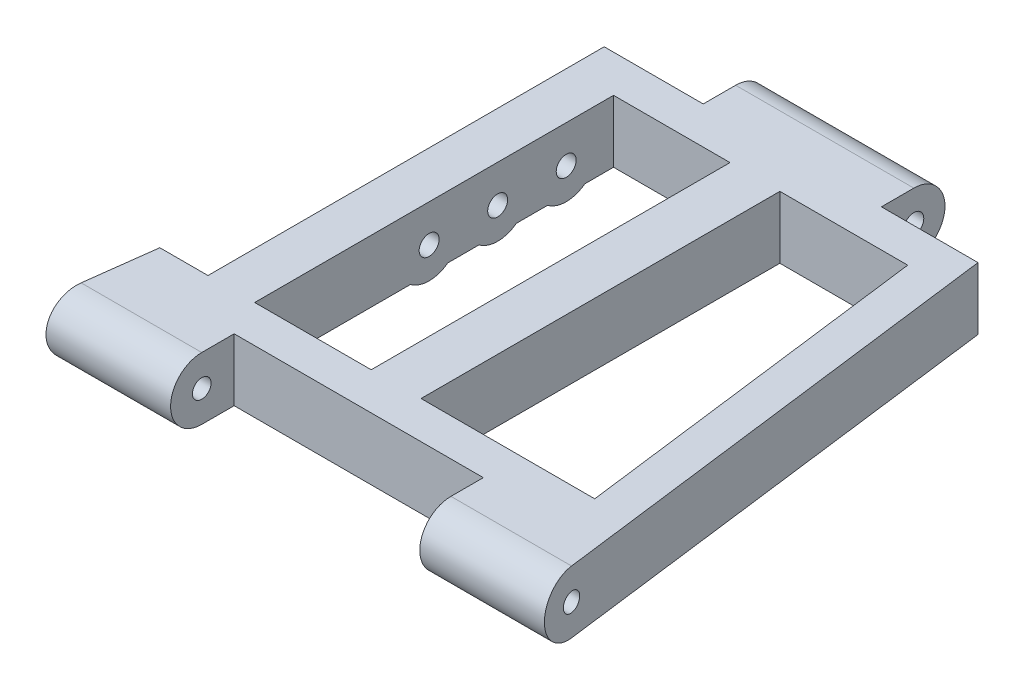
ISO-10303-21;
HEADER;
FILE_DESCRIPTION(('STEP AP214'),'2;1');
FILE_NAME('part.step','',(''),(''),'','','');
FILE_SCHEMA(('AUTOMOTIVE_DESIGN { 1 0 10303 214 1 1 1 1 }'));
ENDSEC;
DATA;
#1=APPLICATION_CONTEXT('core data for automotive mechanical design processes');
#2=APPLICATION_PROTOCOL_DEFINITION('international standard','automotive_design',2000,#1);
#3=PRODUCT_CONTEXT('',#1,'mechanical');
#4=PRODUCT('Part','Part','',(#3));
#5=PRODUCT_RELATED_PRODUCT_CATEGORY('part','',(#4));
#6=PRODUCT_DEFINITION_FORMATION('','',#4);
#7=PRODUCT_DEFINITION_CONTEXT('part definition',#1,'design');
#8=PRODUCT_DEFINITION('design','',#6,#7);
#9=PRODUCT_DEFINITION_SHAPE('','',#8);
#10=(LENGTH_UNIT() NAMED_UNIT(*) SI_UNIT(.MILLI.,.METRE.));
#11=(NAMED_UNIT(*) PLANE_ANGLE_UNIT() SI_UNIT($,.RADIAN.));
#12=(NAMED_UNIT(*) SI_UNIT($,.STERADIAN.) SOLID_ANGLE_UNIT());
#13=UNCERTAINTY_MEASURE_WITH_UNIT(LENGTH_MEASURE(1.E-05),#10,'distance_accuracy_value','');
#14=(GEOMETRIC_REPRESENTATION_CONTEXT(3) GLOBAL_UNCERTAINTY_ASSIGNED_CONTEXT((#13)) GLOBAL_UNIT_ASSIGNED_CONTEXT((#10,
#11,#12)) REPRESENTATION_CONTEXT('',''));
#15=CARTESIAN_POINT('',(0.,0.,0.));
#16=DIRECTION('',(0.,0.,1.));
#17=DIRECTION('',(1.,0.,0.));
#18=AXIS2_PLACEMENT_3D('',#15,#16,#17);
#19=CARTESIAN_POINT('',(0.,0.,0.));
#20=DIRECTION('',(0.,1.,0.));
#21=DIRECTION('',(0.,0.,1.));
#22=AXIS2_PLACEMENT_3D('',#19,#20,#21);
#23=PLANE('',#22);
#24=DIRECTION('',(0.126747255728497,0.,0.991935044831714));
#25=VECTOR('',#24,1.);
#26=CARTESIAN_POINT('',(-62.4809440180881,0.,7.98367618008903));
#27=LINE('',#26,#25);
#28=CARTESIAN_POINT('',(-75.0163050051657,0.,-90.1191489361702));
#29=VERTEX_POINT('',#28);
#30=CARTESIAN_POINT('',(-67.6563050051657,0.,-32.5191489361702));
#31=VERTEX_POINT('',#30);
#32=EDGE_CURVE('E454',#29,#31,#27,.T.);
#33=ORIENTED_EDGE('',*,*,#32,.F.);
#34=DIRECTION('',(1.,0.,0.));
#35=VECTOR('',#34,1.);
#36=CARTESIAN_POINT('',(0.,0.,-90.1191489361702));
#37=LINE('',#36,#35);
#38=CARTESIAN_POINT('',(-95.5375218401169,0.,-90.1191489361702));
#39=VERTEX_POINT('',#38);
#40=EDGE_CURVE('E359',#39,#29,#37,.T.);
#41=ORIENTED_EDGE('',*,*,#40,.F.);
#42=DIRECTION('',(0.,0.,1.));
#43=VECTOR('',#42,1.);
#44=CARTESIAN_POINT('',(-95.5375218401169,0.,0.));
#45=LINE('',#44,#43);
#46=CARTESIAN_POINT('',(-95.5375218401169,0.,-32.5191489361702));
#47=VERTEX_POINT('',#46);
#48=EDGE_CURVE('E510',#39,#47,#45,.T.);
#49=ORIENTED_EDGE('',*,*,#48,.T.);
#50=DIRECTION('',(-1.,0.,0.));
#51=VECTOR('',#50,1.);
#52=CARTESIAN_POINT('',(0.,0.,-32.5191489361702));
#53=LINE('',#52,#51);
#54=EDGE_CURVE('E507',#31,#47,#53,.T.);
#55=ORIENTED_EDGE('',*,*,#54,.F.);
#56=EDGE_LOOP('',(#33,#41,#49,#55));
#57=FACE_BOUND('',#56,.T.);
#58=DIRECTION('',(0.,0.,1.));
#59=VECTOR('',#58,1.);
#60=CARTESIAN_POINT('',(-122.237521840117,0.,0.));
#61=LINE('',#60,#59);
#62=CARTESIAN_POINT('',(-122.237521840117,0.,-90.1191489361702));
#63=VERTEX_POINT('',#62);
#64=CARTESIAN_POINT('',(-122.237521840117,0.,-85.5191489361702));
#65=VERTEX_POINT('',#64);
#66=EDGE_CURVE('E186',#63,#65,#61,.T.);
#67=ORIENTED_EDGE('',*,*,#66,.T.);
#68=DIRECTION('',(-1.,0.,0.));
#69=VECTOR('',#68,1.);
#70=CARTESIAN_POINT('',(-116.154759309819,0.,-85.5191489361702));
#71=LINE('',#70,#69);
#72=CARTESIAN_POINT('',(-129.737521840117,0.,-85.5191489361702));
#73=VERTEX_POINT('',#72);
#74=EDGE_CURVE('E363',#65,#73,#71,.T.);
#75=ORIENTED_EDGE('',*,*,#74,.T.);
#76=DIRECTION('',(0.,0.,-1.));
#77=VECTOR('',#76,1.);
#78=CARTESIAN_POINT('',(-129.737521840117,0.,0.));
#79=LINE('',#78,#77);
#80=CARTESIAN_POINT('',(-129.737521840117,0.,-96.1191489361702));
#81=VERTEX_POINT('',#80);
#82=EDGE_CURVE('E349',#73,#81,#79,.T.);
#83=ORIENTED_EDGE('',*,*,#82,.T.);
#84=DIRECTION('',(1.,0.,0.));
#85=VECTOR('',#84,1.);
#86=CARTESIAN_POINT('',(0.,0.,-96.1191489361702));
#87=LINE('',#86,#85);
#88=CARTESIAN_POINT('',(-113.837521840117,0.,-96.1191489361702));
#89=VERTEX_POINT('',#88);
#90=EDGE_CURVE('E541',#81,#89,#87,.T.);
#91=ORIENTED_EDGE('',*,*,#90,.T.);
#92=DIRECTION('',(0.,0.,1.));
#93=VECTOR('',#92,1.);
#94=CARTESIAN_POINT('',(-113.837521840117,0.,0.));
#95=LINE('',#94,#93);
#96=CARTESIAN_POINT('',(-113.837521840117,0.,-101.31914893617));
#97=VERTEX_POINT('',#96);
#98=EDGE_CURVE('E539',#97,#89,#95,.T.);
#99=ORIENTED_EDGE('',*,*,#98,.F.);
#100=DIRECTION('',(-1.,0.,0.));
#101=VECTOR('',#100,1.);
#102=CARTESIAN_POINT('',(-78.1664540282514,0.,-101.31914893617));
#103=LINE('',#102,#101);
#104=CARTESIAN_POINT('',(-85.2375218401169,0.,-101.31914893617));
#105=VERTEX_POINT('',#104);
#106=EDGE_CURVE('E438',#105,#97,#103,.T.);
#107=ORIENTED_EDGE('',*,*,#106,.F.);
#108=DIRECTION('',(0.,0.,1.));
#109=VECTOR('',#108,1.);
#110=CARTESIAN_POINT('',(-85.2375218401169,0.,0.));
#111=LINE('',#110,#109);
#112=CARTESIAN_POINT('',(-85.2375218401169,0.,-96.1191489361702));
#113=VERTEX_POINT('',#112);
#114=EDGE_CURVE('E537',#105,#113,#111,.T.);
#115=ORIENTED_EDGE('',*,*,#114,.T.);
#116=DIRECTION('',(1.,0.,0.));
#117=VECTOR('',#116,1.);
#118=CARTESIAN_POINT('',(0.,0.,-96.1191489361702));
#119=LINE('',#118,#117);
#120=CARTESIAN_POINT('',(-69.7341885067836,0.,-96.1191489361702));
#121=VERTEX_POINT('',#120);
#122=EDGE_CURVE('E534',#113,#121,#119,.T.);
#123=ORIENTED_EDGE('',*,*,#122,.T.);
#124=DIRECTION('',(0.126747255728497,0.,0.991935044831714));
#125=VECTOR('',#124,1.);
#126=CARTESIAN_POINT('',(-56.5293337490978,0.,7.22319264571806));
#127=LINE('',#126,#125);
#128=CARTESIAN_POINT('',(-60.1764107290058,0.,-21.3191489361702));
#129=VERTEX_POINT('',#128);
#130=EDGE_CURVE('E531',#121,#129,#127,.T.);
#131=ORIENTED_EDGE('',*,*,#130,.T.);
#132=DIRECTION('',(-1.,0.,0.));
#133=VECTOR('',#132,1.);
#134=CARTESIAN_POINT('',(-59.5375218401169,0.,-21.3191489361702));
#135=LINE('',#134,#133);
#136=CARTESIAN_POINT('',(-79.5375218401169,0.,-21.3191489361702));
#137=VERTEX_POINT('',#136);
#138=EDGE_CURVE('E418',#129,#137,#135,.T.);
#139=ORIENTED_EDGE('',*,*,#138,.T.);
#140=DIRECTION('',(0.,0.,1.));
#141=VECTOR('',#140,1.);
#142=CARTESIAN_POINT('',(-79.5375218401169,0.,0.));
#143=LINE('',#142,#141);
#144=CARTESIAN_POINT('',(-79.5375218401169,0.,-26.5191489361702));
#145=VERTEX_POINT('',#144);
#146=EDGE_CURVE('E528',#145,#137,#143,.T.);
#147=ORIENTED_EDGE('',*,*,#146,.F.);
#148=DIRECTION('',(1.,0.,0.));
#149=VECTOR('',#148,1.);
#150=CARTESIAN_POINT('',(0.,0.,-26.5191489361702));
#151=LINE('',#150,#149);
#152=CARTESIAN_POINT('',(-119.537521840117,0.,-26.5191489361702));
#153=VERTEX_POINT('',#152);
#154=EDGE_CURVE('E525',#153,#145,#151,.T.);
#155=ORIENTED_EDGE('',*,*,#154,.F.);
#156=DIRECTION('',(0.,0.,1.));
#157=VECTOR('',#156,1.);
#158=CARTESIAN_POINT('',(-119.537521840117,0.,0.));
#159=LINE('',#158,#157);
#160=CARTESIAN_POINT('',(-119.537521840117,0.,-21.3191489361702));
#161=VERTEX_POINT('',#160);
#162=EDGE_CURVE('E522',#153,#161,#159,.T.);
#163=ORIENTED_EDGE('',*,*,#162,.T.);
#164=CARTESIAN_POINT('',(-138.898632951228,0.,-21.3191489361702));
#165=VERTEX_POINT('',#164);
#166=EDGE_CURVE('E405',#161,#165,#135,.T.);
#167=ORIENTED_EDGE('',*,*,#166,.T.);
#168=DIRECTION('',(-0.126747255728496,0.,0.991935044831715));
#169=VECTOR('',#168,1.);
#170=CARTESIAN_POINT('',(-139.3475958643,0.,-17.805526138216));
#171=LINE('',#170,#169);
#172=CARTESIAN_POINT('',(-137.467521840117,0.,-32.5191489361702));
#173=VERTEX_POINT('',#172);
#174=EDGE_CURVE('E518',#173,#165,#171,.T.);
#175=ORIENTED_EDGE('',*,*,#174,.F.);
#176=DIRECTION('',(-1.,0.,0.));
#177=VECTOR('',#176,1.);
#178=CARTESIAN_POINT('',(0.,0.,-32.5191489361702));
#179=LINE('',#178,#177);
#180=CARTESIAN_POINT('',(-129.737521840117,0.,-32.5191489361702));
#181=VERTEX_POINT('',#180);
#182=EDGE_CURVE('E514',#181,#173,#179,.T.);
#183=ORIENTED_EDGE('',*,*,#182,.F.);
#184=CARTESIAN_POINT('',(-129.737521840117,0.,-57.5191489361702));
#185=VERTEX_POINT('',#184);
#186=EDGE_CURVE('E361',#181,#185,#79,.T.);
#187=ORIENTED_EDGE('',*,*,#186,.T.);
#188=DIRECTION('',(-1.,0.,0.));
#189=VECTOR('',#188,1.);
#190=CARTESIAN_POINT('',(-116.154759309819,0.,-57.5191489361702));
#191=LINE('',#190,#189);
#192=CARTESIAN_POINT('',(-122.237521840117,0.,-57.5191489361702));
#193=VERTEX_POINT('',#192);
#194=EDGE_CURVE('E391',#193,#185,#191,.T.);
#195=ORIENTED_EDGE('',*,*,#194,.F.);
#196=CARTESIAN_POINT('',(-122.237521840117,0.,-32.5191489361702));
#197=VERTEX_POINT('',#196);
#198=EDGE_CURVE('E546',#193,#197,#61,.T.);
#199=ORIENTED_EDGE('',*,*,#198,.T.);
#200=CARTESIAN_POINT('',(-103.537521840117,0.,-32.5191489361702));
#201=VERTEX_POINT('',#200);
#202=EDGE_CURVE('E519',#201,#197,#179,.T.);
#203=ORIENTED_EDGE('',*,*,#202,.F.);
#204=DIRECTION('',(0.,0.,1.));
#205=VECTOR('',#204,1.);
#206=CARTESIAN_POINT('',(-103.537521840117,0.,0.));
#207=LINE('',#206,#205);
#208=CARTESIAN_POINT('',(-103.537521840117,0.,-90.1191489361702));
#209=VERTEX_POINT('',#208);
#210=EDGE_CURVE('E459',#209,#201,#207,.T.);
#211=ORIENTED_EDGE('',*,*,#210,.F.);
#212=DIRECTION('',(1.,0.,0.));
#213=VECTOR('',#212,1.);
#214=CARTESIAN_POINT('',(0.,0.,-90.1191489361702));
#215=LINE('',#214,#213);
#216=EDGE_CURVE('E544',#63,#209,#215,.T.);
#217=ORIENTED_EDGE('',*,*,#216,.F.);
#218=EDGE_LOOP('',(#67,#75,#83,#91,#99,#107,#115,#123,#131,#139,#147,#155,#163,#167,#175,#183,
#187,#195,#199,#203,#211,#217));
#219=FACE_BOUND('',#218,.T.);
#220=ADVANCED_FACE('F163',(#57,#219),#23,.F.);
#221=CARTESIAN_POINT('',(-129.737521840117,0.,-74.5191489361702));
#222=VERTEX_POINT('',#221);
#223=CARTESIAN_POINT('',(-129.737521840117,0.,-79.5191489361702));
#224=VERTEX_POINT('',#223);
#225=EDGE_CURVE('E358',#222,#224,#79,.T.);
#226=ORIENTED_EDGE('',*,*,#225,.T.);
#227=DIRECTION('',(-1.,0.,0.));
#228=VECTOR('',#227,1.);
#229=CARTESIAN_POINT('',(-116.154759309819,0.,-79.5191489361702));
#230=LINE('',#229,#228);
#231=CARTESIAN_POINT('',(-122.237521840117,0.,-79.5191489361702));
#232=VERTEX_POINT('',#231);
#233=EDGE_CURVE('E178',#232,#224,#230,.T.);
#234=ORIENTED_EDGE('',*,*,#233,.F.);
#235=CARTESIAN_POINT('',(-122.237521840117,0.,-74.5191489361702));
#236=VERTEX_POINT('',#235);
#237=EDGE_CURVE('E545',#232,#236,#61,.T.);
#238=ORIENTED_EDGE('',*,*,#237,.T.);
#239=DIRECTION('',(-1.,0.,0.));
#240=VECTOR('',#239,1.);
#241=CARTESIAN_POINT('',(-116.154759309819,0.,-74.5191489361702));
#242=LINE('',#241,#240);
#243=EDGE_CURVE('E382',#236,#222,#242,.T.);
#244=ORIENTED_EDGE('',*,*,#243,.T.);
#245=EDGE_LOOP('',(#226,#234,#238,#244));
#246=FACE_BOUND('',#245,.T.);
#247=ADVANCED_FACE('F650',(#246),#23,.F.);
#248=CARTESIAN_POINT('',(-139.3475958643,10.,-17.805526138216));
#249=DIRECTION('',(0.991935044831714,0.,0.126747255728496));
#250=DIRECTION('',(0.126747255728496,0.,-0.991935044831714));
#251=AXIS2_PLACEMENT_3D('',#248,#249,#250);
#252=PLANE('',#251);
#253=CARTESIAN_POINT('',(-138.898632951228,5.,-21.3191489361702));
#254=DIRECTION('',(0.991935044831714,0.,0.126747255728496));
#255=DIRECTION('',(-0.126747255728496,0.,0.991935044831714));
#256=AXIS2_PLACEMENT_3D('',#253,#254,#255);
#257=ELLIPSE('',#256,1.5121957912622,1.5);
#258=CARTESIAN_POINT('',(-139.090299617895,5.,-19.8191489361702));
#259=VERTEX_POINT('',#258);
#260=EDGE_CURVE('E429',#259,#259,#257,.T.);
#261=ORIENTED_EDGE('',*,*,#260,.T.);
#262=EDGE_LOOP('',(#261));
#263=FACE_BOUND('',#262,.T.);
#264=ORIENTED_EDGE('',*,*,#174,.T.);
#265=CARTESIAN_POINT('',(-138.898632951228,5.,-21.3191489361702));
#266=DIRECTION('',(0.991935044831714,0.,0.126747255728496));
#267=DIRECTION('',(-0.126747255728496,0.,0.991935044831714));
#268=AXIS2_PLACEMENT_3D('',#265,#266,#267);
#269=ELLIPSE('',#268,5.04065263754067,5.);
#270=CARTESIAN_POINT('',(-138.898632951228,10.,-21.3191489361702));
#271=VERTEX_POINT('',#270);
#272=EDGE_CURVE('E436',#271,#165,#269,.T.);
#273=ORIENTED_EDGE('',*,*,#272,.F.);
#274=DIRECTION('',(-0.126747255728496,0.,0.991935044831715));
#275=VECTOR('',#274,1.);
#276=CARTESIAN_POINT('',(-139.3475958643,10.,-17.805526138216));
#277=LINE('',#276,#275);
#278=CARTESIAN_POINT('',(-137.467521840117,10.,-32.5191489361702));
#279=VERTEX_POINT('',#278);
#280=EDGE_CURVE('E471',#279,#271,#277,.T.);
#281=ORIENTED_EDGE('',*,*,#280,.F.);
#282=DIRECTION('',(0.,-1.,0.));
#283=VECTOR('',#282,1.);
#284=CARTESIAN_POINT('',(-137.467521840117,10.,-32.5191489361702));
#285=LINE('',#284,#283);
#286=EDGE_CURVE('E575',#279,#173,#285,.T.);
#287=ORIENTED_EDGE('',*,*,#286,.T.);
#288=EDGE_LOOP('',(#264,#273,#281,#287));
#289=FACE_BOUND('',#288,.T.);
#290=ADVANCED_FACE('F617',(#263,#289),#252,.F.);
#291=CARTESIAN_POINT('',(-119.537521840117,10.,0.));
#292=DIRECTION('',(1.,0.,0.));
#293=DIRECTION('',(0.,0.,-1.));
#294=AXIS2_PLACEMENT_3D('',#291,#292,#293);
#295=PLANE('',#294);
#296=CARTESIAN_POINT('',(-119.537521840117,5.,-21.3191489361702));
#297=DIRECTION('',(1.,0.,0.));
#298=DIRECTION('',(0.,0.,-1.));
#299=AXIS2_PLACEMENT_3D('',#296,#297,#298);
#300=CIRCLE('',#299,1.5);
#301=CARTESIAN_POINT('',(-119.537521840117,5.,-22.8191489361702));
#302=VERTEX_POINT('',#301);
#303=EDGE_CURVE('E425',#302,#302,#300,.T.);
#304=ORIENTED_EDGE('',*,*,#303,.F.);
#305=EDGE_LOOP('',(#304));
#306=FACE_BOUND('',#305,.T.);
#307=CARTESIAN_POINT('',(-119.537521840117,5.,-21.3191489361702));
#308=DIRECTION('',(1.,0.,0.));
#309=DIRECTION('',(0.,0.,-1.));
#310=AXIS2_PLACEMENT_3D('',#307,#308,#309);
#311=CIRCLE('',#310,5.);
#312=CARTESIAN_POINT('',(-119.537521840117,10.,-21.3191489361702));
#313=VERTEX_POINT('',#312);
#314=EDGE_CURVE('E434',#313,#161,#311,.T.);
#315=ORIENTED_EDGE('',*,*,#314,.T.);
#316=ORIENTED_EDGE('',*,*,#162,.F.);
#317=DIRECTION('',(0.,-1.,0.));
#318=VECTOR('',#317,1.);
#319=CARTESIAN_POINT('',(-119.537521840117,10.,-26.5191489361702));
#320=LINE('',#319,#318);
#321=CARTESIAN_POINT('',(-119.537521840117,10.,-26.5191489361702));
#322=VERTEX_POINT('',#321);
#323=EDGE_CURVE('E573',#322,#153,#320,.T.);
#324=ORIENTED_EDGE('',*,*,#323,.F.);
#325=DIRECTION('',(0.,0.,1.));
#326=VECTOR('',#325,1.);
#327=CARTESIAN_POINT('',(-119.537521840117,10.,0.));
#328=LINE('',#327,#326);
#329=EDGE_CURVE('E475',#322,#313,#328,.T.);
#330=ORIENTED_EDGE('',*,*,#329,.T.);
#331=EDGE_LOOP('',(#315,#316,#324,#330));
#332=FACE_BOUND('',#331,.T.);
#333=ADVANCED_FACE('F610',(#306,#332),#295,.T.);
#334=CARTESIAN_POINT('',(-79.5375218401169,10.,0.));
#335=DIRECTION('',(1.,0.,0.));
#336=DIRECTION('',(0.,0.,-1.));
#337=AXIS2_PLACEMENT_3D('',#334,#335,#336);
#338=PLANE('',#337);
#339=CARTESIAN_POINT('',(-79.5375218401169,5.,-21.3191489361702));
#340=DIRECTION('',(1.,0.,0.));
#341=DIRECTION('',(0.,0.,-1.));
#342=AXIS2_PLACEMENT_3D('',#339,#340,#341);
#343=CIRCLE('',#342,1.5);
#344=CARTESIAN_POINT('',(-79.5375218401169,5.,-22.8191489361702));
#345=VERTEX_POINT('',#344);
#346=EDGE_CURVE('E422',#345,#345,#343,.T.);
#347=ORIENTED_EDGE('',*,*,#346,.T.);
#348=EDGE_LOOP('',(#347));
#349=FACE_BOUND('',#348,.T.);
#350=ORIENTED_EDGE('',*,*,#146,.T.);
#351=CARTESIAN_POINT('',(-79.5375218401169,5.,-21.3191489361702));
#352=DIRECTION('',(1.,0.,0.));
#353=DIRECTION('',(0.,0.,-1.));
#354=AXIS2_PLACEMENT_3D('',#351,#352,#353);
#355=CIRCLE('',#354,5.);
#356=CARTESIAN_POINT('',(-79.5375218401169,10.,-21.3191489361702));
#357=VERTEX_POINT('',#356);
#358=EDGE_CURVE('E432',#357,#137,#355,.T.);
#359=ORIENTED_EDGE('',*,*,#358,.F.);
#360=DIRECTION('',(0.,0.,1.));
#361=VECTOR('',#360,1.);
#362=CARTESIAN_POINT('',(-79.5375218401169,10.,0.));
#363=LINE('',#362,#361);
#364=CARTESIAN_POINT('',(-79.5375218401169,10.,-26.5191489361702));
#365=VERTEX_POINT('',#364);
#366=EDGE_CURVE('E481',#365,#357,#363,.T.);
#367=ORIENTED_EDGE('',*,*,#366,.F.);
#368=DIRECTION('',(0.,-1.,0.));
#369=VECTOR('',#368,1.);
#370=CARTESIAN_POINT('',(-79.5375218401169,10.,-26.5191489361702));
#371=LINE('',#370,#369);
#372=EDGE_CURVE('E570',#365,#145,#371,.T.);
#373=ORIENTED_EDGE('',*,*,#372,.T.);
#374=EDGE_LOOP('',(#350,#359,#367,#373));
#375=FACE_BOUND('',#374,.T.);
#376=ADVANCED_FACE('F598',(#349,#375),#338,.F.);
#377=CARTESIAN_POINT('',(-56.5293337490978,10.,7.22319264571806));
#378=DIRECTION('',(0.991935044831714,0.,-0.126747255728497));
#379=DIRECTION('',(-0.126747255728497,0.,-0.991935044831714));
#380=AXIS2_PLACEMENT_3D('',#377,#378,#379);
#381=PLANE('',#380);
#382=CARTESIAN_POINT('',(-60.1764107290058,5.,-21.3191489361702));
#383=DIRECTION('',(0.991935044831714,0.,-0.126747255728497));
#384=DIRECTION('',(-0.126747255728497,0.,-0.991935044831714));
#385=AXIS2_PLACEMENT_3D('',#382,#383,#384);
#386=ELLIPSE('',#385,1.5121957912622,1.5);
#387=CARTESIAN_POINT('',(-60.3680773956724,5.,-22.8191489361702));
#388=VERTEX_POINT('',#387);
#389=EDGE_CURVE('E426',#388,#388,#386,.T.);
#390=ORIENTED_EDGE('',*,*,#389,.F.);
#391=EDGE_LOOP('',(#390));
#392=FACE_BOUND('',#391,.T.);
#393=CARTESIAN_POINT('',(-60.1764107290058,5.,-21.3191489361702));
#394=DIRECTION('',(0.991935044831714,0.,-0.126747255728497));
#395=DIRECTION('',(-0.126747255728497,0.,-0.991935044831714));
#396=AXIS2_PLACEMENT_3D('',#393,#394,#395);
#397=ELLIPSE('',#396,5.04065263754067,5.);
#398=CARTESIAN_POINT('',(-60.1764107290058,10.,-21.3191489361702));
#399=VERTEX_POINT('',#398);
#400=EDGE_CURVE('E12',#399,#129,#397,.T.);
#401=ORIENTED_EDGE('',*,*,#400,.T.);
#402=ORIENTED_EDGE('',*,*,#130,.F.);
#403=DIRECTION('',(0.,-1.,0.));
#404=VECTOR('',#403,1.);
#405=CARTESIAN_POINT('',(-69.7341885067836,10.,-96.1191489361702));
#406=LINE('',#405,#404);
#407=CARTESIAN_POINT('',(-69.7341885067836,10.,-96.1191489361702));
#408=VERTEX_POINT('',#407);
#409=EDGE_CURVE('E568',#408,#121,#406,.T.);
#410=ORIENTED_EDGE('',*,*,#409,.F.);
#411=DIRECTION('',(0.126747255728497,0.,0.991935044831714));
#412=VECTOR('',#411,1.);
#413=CARTESIAN_POINT('',(-56.5293337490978,10.,7.22319264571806));
#414=LINE('',#413,#412);
#415=EDGE_CURVE('E484',#408,#399,#414,.T.);
#416=ORIENTED_EDGE('',*,*,#415,.T.);
#417=EDGE_LOOP('',(#401,#402,#410,#416));
#418=FACE_BOUND('',#417,.T.);
#419=ADVANCED_FACE('F723',(#392,#418),#381,.T.);
#420=CARTESIAN_POINT('',(-85.2375218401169,10.,0.));
#421=DIRECTION('',(1.,0.,0.));
#422=DIRECTION('',(0.,0.,-1.));
#423=AXIS2_PLACEMENT_3D('',#420,#421,#422);
#424=PLANE('',#423);
#425=CARTESIAN_POINT('',(-85.2375218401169,5.,-101.31914893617));
#426=DIRECTION('',(1.,0.,0.));
#427=DIRECTION('',(0.,0.,-1.));
#428=AXIS2_PLACEMENT_3D('',#425,#426,#427);
#429=CIRCLE('',#428,1.60000000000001);
#430=CARTESIAN_POINT('',(-85.2375218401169,5.,-102.91914893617));
#431=VERTEX_POINT('',#430);
#432=EDGE_CURVE('E451',#431,#431,#429,.F.);
#433=ORIENTED_EDGE('',*,*,#432,.T.);
#434=EDGE_LOOP('',(#433));
#435=FACE_BOUND('',#434,.T.);
#436=ORIENTED_EDGE('',*,*,#114,.F.);
#437=CARTESIAN_POINT('',(-85.2375218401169,5.,-101.31914893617));
#438=DIRECTION('',(1.,0.,0.));
#439=DIRECTION('',(0.,0.,-1.));
#440=AXIS2_PLACEMENT_3D('',#437,#438,#439);
#441=CIRCLE('',#440,5.);
#442=CARTESIAN_POINT('',(-85.2375218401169,10.,-101.31914893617));
#443=VERTEX_POINT('',#442);
#444=EDGE_CURVE('E441',#443,#105,#441,.F.);
#445=ORIENTED_EDGE('',*,*,#444,.F.);
#446=DIRECTION('',(0.,0.,1.));
#447=VECTOR('',#446,1.);
#448=CARTESIAN_POINT('',(-85.2375218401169,10.,0.));
#449=LINE('',#448,#447);
#450=CARTESIAN_POINT('',(-85.2375218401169,10.,-96.1191489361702));
#451=VERTEX_POINT('',#450);
#452=EDGE_CURVE('E490',#443,#451,#449,.T.);
#453=ORIENTED_EDGE('',*,*,#452,.T.);
#454=DIRECTION('',(0.,-1.,0.));
#455=VECTOR('',#454,1.);
#456=CARTESIAN_POINT('',(-85.2375218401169,10.,-96.1191489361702));
#457=LINE('',#456,#455);
#458=EDGE_CURVE('E565',#451,#113,#457,.T.);
#459=ORIENTED_EDGE('',*,*,#458,.T.);
#460=EDGE_LOOP('',(#436,#445,#453,#459));
#461=FACE_BOUND('',#460,.T.);
#462=ADVANCED_FACE('F664',(#435,#461),#424,.T.);
#463=CARTESIAN_POINT('',(-113.837521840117,10.,0.));
#464=DIRECTION('',(1.,0.,0.));
#465=DIRECTION('',(0.,0.,-1.));
#466=AXIS2_PLACEMENT_3D('',#463,#464,#465);
#467=PLANE('',#466);
#468=CARTESIAN_POINT('',(-113.837521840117,5.,-101.31914893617));
#469=DIRECTION('',(-1.,0.,0.));
#470=DIRECTION('',(0.,0.,1.));
#471=AXIS2_PLACEMENT_3D('',#468,#469,#470);
#472=CIRCLE('',#471,1.60000000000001);
#473=CARTESIAN_POINT('',(-113.837521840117,5.,-99.7191489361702));
#474=VERTEX_POINT('',#473);
#475=EDGE_CURVE('E444',#474,#474,#472,.T.);
#476=ORIENTED_EDGE('',*,*,#475,.F.);
#477=EDGE_LOOP('',(#476));
#478=FACE_BOUND('',#477,.T.);
#479=CARTESIAN_POINT('',(-113.837521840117,5.,-101.31914893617));
#480=DIRECTION('',(-1.,0.,0.));
#481=DIRECTION('',(0.,0.,1.));
#482=AXIS2_PLACEMENT_3D('',#479,#480,#481);
#483=CIRCLE('',#482,5.);
#484=CARTESIAN_POINT('',(-113.837521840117,10.,-101.31914893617));
#485=VERTEX_POINT('',#484);
#486=EDGE_CURVE('E442',#485,#97,#483,.T.);
#487=ORIENTED_EDGE('',*,*,#486,.T.);
#488=ORIENTED_EDGE('',*,*,#98,.T.);
#489=DIRECTION('',(0.,-1.,0.));
#490=VECTOR('',#489,1.);
#491=CARTESIAN_POINT('',(-113.837521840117,10.,-96.1191489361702));
#492=LINE('',#491,#490);
#493=CARTESIAN_POINT('',(-113.837521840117,10.,-96.1191489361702));
#494=VERTEX_POINT('',#493);
#495=EDGE_CURVE('E561',#494,#89,#492,.T.);
#496=ORIENTED_EDGE('',*,*,#495,.F.);
#497=DIRECTION('',(0.,0.,1.));
#498=VECTOR('',#497,1.);
#499=CARTESIAN_POINT('',(-113.837521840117,10.,0.));
#500=LINE('',#499,#498);
#501=EDGE_CURVE('E492',#485,#494,#500,.T.);
#502=ORIENTED_EDGE('',*,*,#501,.F.);
#503=EDGE_LOOP('',(#487,#488,#496,#502));
#504=FACE_BOUND('',#503,.T.);
#505=ADVANCED_FACE('F657',(#478,#504),#467,.F.);
#506=CARTESIAN_POINT('',(-129.737521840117,0.,-63.5191489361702));
#507=VERTEX_POINT('',#506);
#508=CARTESIAN_POINT('',(-129.737521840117,0.,-68.5191489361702));
#509=VERTEX_POINT('',#508);
#510=EDGE_CURVE('E515',#507,#509,#79,.T.);
#511=ORIENTED_EDGE('',*,*,#510,.T.);
#512=DIRECTION('',(-1.,0.,0.));
#513=VECTOR('',#512,1.);
#514=CARTESIAN_POINT('',(-116.154759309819,0.,-68.5191489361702));
#515=LINE('',#514,#513);
#516=CARTESIAN_POINT('',(-122.237521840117,0.,-68.5191489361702));
#517=VERTEX_POINT('',#516);
#518=EDGE_CURVE('E379',#517,#509,#515,.T.);
#519=ORIENTED_EDGE('',*,*,#518,.F.);
#520=CARTESIAN_POINT('',(-122.237521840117,0.,-63.5191489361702));
#521=VERTEX_POINT('',#520);
#522=EDGE_CURVE('E634',#517,#521,#61,.T.);
#523=ORIENTED_EDGE('',*,*,#522,.T.);
#524=DIRECTION('',(-1.,0.,0.));
#525=VECTOR('',#524,1.);
#526=CARTESIAN_POINT('',(-116.154759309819,0.,-63.5191489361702));
#527=LINE('',#526,#525);
#528=EDGE_CURVE('E394',#521,#507,#527,.T.);
#529=ORIENTED_EDGE('',*,*,#528,.T.);
#530=EDGE_LOOP('',(#511,#519,#523,#529));
#531=FACE_BOUND('',#530,.T.);
#532=ADVANCED_FACE('F655',(#531),#23,.F.);
#533=CARTESIAN_POINT('',(0.,10.,0.));
#534=DIRECTION('',(0.,1.,0.));
#535=DIRECTION('',(0.,0.,1.));
#536=AXIS2_PLACEMENT_3D('',#533,#534,#535);
#537=PLANE('',#536);
#538=DIRECTION('',(-1.,0.,0.));
#539=VECTOR('',#538,1.);
#540=CARTESIAN_POINT('',(-59.5375218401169,10.,-21.3191489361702));
#541=LINE('',#540,#539);
#542=EDGE_CURVE('E421',#399,#357,#541,.T.);
#543=ORIENTED_EDGE('',*,*,#542,.F.);
#544=ORIENTED_EDGE('',*,*,#415,.F.);
#545=DIRECTION('',(1.,0.,0.));
#546=VECTOR('',#545,1.);
#547=CARTESIAN_POINT('',(0.,10.,-96.1191489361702));
#548=LINE('',#547,#546);
#549=EDGE_CURVE('E487',#451,#408,#548,.T.);
#550=ORIENTED_EDGE('',*,*,#549,.F.);
#551=ORIENTED_EDGE('',*,*,#452,.F.);
#552=DIRECTION('',(-1.,0.,0.));
#553=VECTOR('',#552,1.);
#554=CARTESIAN_POINT('',(-78.1664540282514,10.,-101.31914893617));
#555=LINE('',#554,#553);
#556=EDGE_CURVE('E445',#443,#485,#555,.T.);
#557=ORIENTED_EDGE('',*,*,#556,.T.);
#558=ORIENTED_EDGE('',*,*,#501,.T.);
#559=DIRECTION('',(1.,0.,0.));
#560=VECTOR('',#559,1.);
#561=CARTESIAN_POINT('',(0.,10.,-96.1191489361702));
#562=LINE('',#561,#560);
#563=CARTESIAN_POINT('',(-129.737521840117,10.,-96.1191489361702));
#564=VERTEX_POINT('',#563);
#565=EDGE_CURVE('E494',#564,#494,#562,.T.);
#566=ORIENTED_EDGE('',*,*,#565,.F.);
#567=DIRECTION('',(0.,0.,-1.));
#568=VECTOR('',#567,1.);
#569=CARTESIAN_POINT('',(-129.737521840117,10.,0.));
#570=LINE('',#569,#568);
#571=CARTESIAN_POINT('',(-129.737521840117,10.,-32.5191489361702));
#572=VERTEX_POINT('',#571);
#573=EDGE_CURVE('E466',#572,#564,#570,.T.);
#574=ORIENTED_EDGE('',*,*,#573,.F.);
#575=DIRECTION('',(-1.,0.,0.));
#576=VECTOR('',#575,1.);
#577=CARTESIAN_POINT('',(0.,10.,-32.5191489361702));
#578=LINE('',#577,#576);
#579=EDGE_CURVE('E468',#572,#279,#578,.T.);
#580=ORIENTED_EDGE('',*,*,#579,.T.);
#581=ORIENTED_EDGE('',*,*,#280,.T.);
#582=EDGE_CURVE('E419',#313,#271,#541,.T.);
#583=ORIENTED_EDGE('',*,*,#582,.F.);
#584=ORIENTED_EDGE('',*,*,#329,.F.);
#585=DIRECTION('',(1.,0.,0.));
#586=VECTOR('',#585,1.);
#587=CARTESIAN_POINT('',(0.,10.,-26.5191489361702));
#588=LINE('',#587,#586);
#589=EDGE_CURVE('E478',#322,#365,#588,.T.);
#590=ORIENTED_EDGE('',*,*,#589,.T.);
#591=ORIENTED_EDGE('',*,*,#366,.T.);
#592=EDGE_LOOP('',(#543,#544,#550,#551,#557,#558,#566,#574,#580,#581,#583,#584,#590,#591));
#593=FACE_BOUND('',#592,.T.);
#594=DIRECTION('',(0.126747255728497,0.,0.991935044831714));
#595=VECTOR('',#594,1.);
#596=CARTESIAN_POINT('',(-62.4809440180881,10.,7.98367618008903));
#597=LINE('',#596,#595);
#598=CARTESIAN_POINT('',(-75.0163050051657,10.,-90.1191489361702));
#599=VERTEX_POINT('',#598);
#600=CARTESIAN_POINT('',(-67.6563050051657,10.,-32.5191489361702));
#601=VERTEX_POINT('',#600);
#602=EDGE_CURVE('E455',#599,#601,#597,.T.);
#603=ORIENTED_EDGE('',*,*,#602,.T.);
#604=DIRECTION('',(-1.,0.,0.));
#605=VECTOR('',#604,1.);
#606=CARTESIAN_POINT('',(0.,10.,-32.5191489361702));
#607=LINE('',#606,#605);
#608=CARTESIAN_POINT('',(-95.5375218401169,10.,-32.5191489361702));
#609=VERTEX_POINT('',#608);
#610=EDGE_CURVE('E458',#601,#609,#607,.T.);
#611=ORIENTED_EDGE('',*,*,#610,.T.);
#612=DIRECTION('',(0.,0.,1.));
#613=VECTOR('',#612,1.);
#614=CARTESIAN_POINT('',(-95.5375218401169,10.,0.));
#615=LINE('',#614,#613);
#616=CARTESIAN_POINT('',(-95.5375218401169,10.,-90.1191489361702));
#617=VERTEX_POINT('',#616);
#618=EDGE_CURVE('E461',#617,#609,#615,.T.);
#619=ORIENTED_EDGE('',*,*,#618,.F.);
#620=DIRECTION('',(1.,0.,0.));
#621=VECTOR('',#620,1.);
#622=CARTESIAN_POINT('',(0.,10.,-90.1191489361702));
#623=LINE('',#622,#621);
#624=EDGE_CURVE('E464',#617,#599,#623,.T.);
#625=ORIENTED_EDGE('',*,*,#624,.T.);
#626=EDGE_LOOP('',(#603,#611,#619,#625));
#627=FACE_BOUND('',#626,.T.);
#628=CARTESIAN_POINT('',(-103.537521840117,10.,-32.5191489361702));
#629=VERTEX_POINT('',#628);
#630=CARTESIAN_POINT('',(-122.237521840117,10.,-32.5191489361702));
#631=VERTEX_POINT('',#630);
#632=EDGE_CURVE('E472',#629,#631,#578,.T.);
#633=ORIENTED_EDGE('',*,*,#632,.T.);
#634=DIRECTION('',(0.,0.,1.));
#635=VECTOR('',#634,1.);
#636=CARTESIAN_POINT('',(-122.237521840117,10.,0.));
#637=LINE('',#636,#635);
#638=CARTESIAN_POINT('',(-122.237521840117,10.,-90.1191489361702));
#639=VERTEX_POINT('',#638);
#640=EDGE_CURVE('E497',#639,#631,#637,.T.);
#641=ORIENTED_EDGE('',*,*,#640,.F.);
#642=DIRECTION('',(1.,0.,0.));
#643=VECTOR('',#642,1.);
#644=CARTESIAN_POINT('',(0.,10.,-90.1191489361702));
#645=LINE('',#644,#643);
#646=CARTESIAN_POINT('',(-103.537521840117,10.,-90.1191489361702));
#647=VERTEX_POINT('',#646);
#648=EDGE_CURVE('E500',#639,#647,#645,.T.);
#649=ORIENTED_EDGE('',*,*,#648,.T.);
#650=DIRECTION('',(0.,0.,1.));
#651=VECTOR('',#650,1.);
#652=CARTESIAN_POINT('',(-103.537521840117,10.,0.));
#653=LINE('',#652,#651);
#654=EDGE_CURVE('E502',#647,#629,#653,.T.);
#655=ORIENTED_EDGE('',*,*,#654,.T.);
#656=EDGE_LOOP('',(#633,#641,#649,#655));
#657=FACE_BOUND('',#656,.T.);
#658=ADVANCED_FACE('F599',(#593,#627,#657),#537,.T.);
#659=CARTESIAN_POINT('',(0.,10.,-32.5191489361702));
#660=DIRECTION('',(0.,0.,1.));
#661=DIRECTION('',(1.,0.,0.));
#662=AXIS2_PLACEMENT_3D('',#659,#660,#661);
#663=PLANE('',#662);
#664=ORIENTED_EDGE('',*,*,#202,.T.);
#665=DIRECTION('',(0.,-1.,0.));
#666=VECTOR('',#665,1.);
#667=CARTESIAN_POINT('',(-122.237521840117,10.,-32.5191489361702));
#668=LINE('',#667,#666);
#669=EDGE_CURVE('E171',#631,#197,#668,.T.);
#670=ORIENTED_EDGE('',*,*,#669,.F.);
#671=ORIENTED_EDGE('',*,*,#632,.F.);
#672=DIRECTION('',(0.,-1.,0.));
#673=VECTOR('',#672,1.);
#674=CARTESIAN_POINT('',(-103.537521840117,10.,-32.5191489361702));
#675=LINE('',#674,#673);
#676=EDGE_CURVE('E549',#629,#201,#675,.T.);
#677=ORIENTED_EDGE('',*,*,#676,.T.);
#678=EDGE_LOOP('',(#664,#670,#671,#677));
#679=FACE_BOUND('',#678,.T.);
#680=ADVANCED_FACE('F636',(#679),#663,.F.);
#681=CARTESIAN_POINT('',(-122.237521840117,10.,0.));
#682=DIRECTION('',(1.,0.,0.));
#683=DIRECTION('',(0.,0.,-1.));
#684=AXIS2_PLACEMENT_3D('',#681,#682,#683);
#685=PLANE('',#684);
#686=CARTESIAN_POINT('',(-122.237521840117,4.,-60.5191489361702));
#687=DIRECTION('',(1.,0.,0.));
#688=DIRECTION('',(0.,0.,-1.));
#689=AXIS2_PLACEMENT_3D('',#686,#687,#688);
#690=CIRCLE('',#689,1.60000000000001);
#691=CARTESIAN_POINT('',(-122.237521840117,4.,-58.9191489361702));
#692=VERTEX_POINT('',#691);
#693=EDGE_CURVE('E401',#692,#692,#690,.F.);
#694=ORIENTED_EDGE('',*,*,#693,.T.);
#695=EDGE_LOOP('',(#694));
#696=FACE_BOUND('',#695,.T.);
#697=CARTESIAN_POINT('',(-122.237521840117,4.,-71.5191489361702));
#698=DIRECTION('',(1.,0.,0.));
#699=DIRECTION('',(0.,0.,-1.));
#700=AXIS2_PLACEMENT_3D('',#697,#698,#699);
#701=CIRCLE('',#700,1.60000000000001);
#702=CARTESIAN_POINT('',(-122.237521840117,4.,-69.9191489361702));
#703=VERTEX_POINT('',#702);
#704=EDGE_CURVE('E402',#703,#703,#701,.F.);
#705=ORIENTED_EDGE('',*,*,#704,.T.);
#706=EDGE_LOOP('',(#705));
#707=FACE_BOUND('',#706,.T.);
#708=CARTESIAN_POINT('',(-122.237521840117,4.,-82.5191489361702));
#709=DIRECTION('',(1.,0.,0.));
#710=DIRECTION('',(0.,0.,-1.));
#711=AXIS2_PLACEMENT_3D('',#708,#709,#710);
#712=CIRCLE('',#711,1.60000000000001);
#713=CARTESIAN_POINT('',(-122.237521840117,4.,-80.9191489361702));
#714=VERTEX_POINT('',#713);
#715=EDGE_CURVE('E409',#714,#714,#712,.F.);
#716=ORIENTED_EDGE('',*,*,#715,.T.);
#717=EDGE_LOOP('',(#716));
#718=FACE_BOUND('',#717,.T.);
#719=ORIENTED_EDGE('',*,*,#66,.F.);
#720=DIRECTION('',(0.,-1.,0.));
#721=VECTOR('',#720,1.);
#722=CARTESIAN_POINT('',(-122.237521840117,10.,-90.1191489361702));
#723=LINE('',#722,#721);
#724=EDGE_CURVE('E556',#639,#63,#723,.T.);
#725=ORIENTED_EDGE('',*,*,#724,.F.);
#726=ORIENTED_EDGE('',*,*,#640,.T.);
#727=ORIENTED_EDGE('',*,*,#669,.T.);
#728=ORIENTED_EDGE('',*,*,#198,.F.);
#729=CARTESIAN_POINT('',(-122.237521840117,4.,-60.5191489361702));
#730=DIRECTION('',(1.,0.,0.));
#731=DIRECTION('',(0.,0.,-1.));
#732=AXIS2_PLACEMENT_3D('',#729,#730,#731);
#733=CIRCLE('',#732,5.);
#734=EDGE_CURVE('E388',#521,#193,#733,.F.);
#735=ORIENTED_EDGE('',*,*,#734,.F.);
#736=ORIENTED_EDGE('',*,*,#522,.F.);
#737=CARTESIAN_POINT('',(-122.237521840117,4.,-71.5191489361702));
#738=DIRECTION('',(1.,0.,0.));
#739=DIRECTION('',(0.,0.,-1.));
#740=AXIS2_PLACEMENT_3D('',#737,#738,#739);
#741=CIRCLE('',#740,5.);
#742=EDGE_CURVE('E376',#236,#517,#741,.F.);
#743=ORIENTED_EDGE('',*,*,#742,.F.);
#744=ORIENTED_EDGE('',*,*,#237,.F.);
#745=CARTESIAN_POINT('',(-122.237521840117,4.,-82.5191489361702));
#746=DIRECTION('',(1.,0.,0.));
#747=DIRECTION('',(0.,0.,-1.));
#748=AXIS2_PLACEMENT_3D('',#745,#746,#747);
#749=CIRCLE('',#748,5.);
#750=EDGE_CURVE('E369',#65,#232,#749,.F.);
#751=ORIENTED_EDGE('',*,*,#750,.F.);
#752=EDGE_LOOP('',(#719,#725,#726,#727,#728,#735,#736,#743,#744,#751));
#753=FACE_BOUND('',#752,.T.);
#754=ADVANCED_FACE('F630',(#696,#707,#718,#753),#685,.T.);
#755=CARTESIAN_POINT('',(0.,10.,-90.1191489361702));
#756=DIRECTION('',(0.,0.,-1.));
#757=DIRECTION('',(-1.,0.,0.));
#758=AXIS2_PLACEMENT_3D('',#755,#756,#757);
#759=PLANE('',#758);
#760=ORIENTED_EDGE('',*,*,#216,.T.);
#761=DIRECTION('',(0.,-1.,0.));
#762=VECTOR('',#761,1.);
#763=CARTESIAN_POINT('',(-103.537521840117,10.,-90.1191489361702));
#764=LINE('',#763,#762);
#765=EDGE_CURVE('E552',#647,#209,#764,.T.);
#766=ORIENTED_EDGE('',*,*,#765,.F.);
#767=ORIENTED_EDGE('',*,*,#648,.F.);
#768=ORIENTED_EDGE('',*,*,#724,.T.);
#769=EDGE_LOOP('',(#760,#766,#767,#768));
#770=FACE_BOUND('',#769,.T.);
#771=ADVANCED_FACE('F646',(#770),#759,.F.);
#772=CARTESIAN_POINT('',(-129.737521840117,10.,0.));
#773=DIRECTION('',(-1.,0.,0.));
#774=DIRECTION('',(0.,0.,1.));
#775=AXIS2_PLACEMENT_3D('',#772,#773,#774);
#776=PLANE('',#775);
#777=CARTESIAN_POINT('',(-129.737521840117,4.,-60.5191489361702));
#778=DIRECTION('',(-1.,0.,0.));
#779=DIRECTION('',(0.,0.,1.));
#780=AXIS2_PLACEMENT_3D('',#777,#778,#779);
#781=CIRCLE('',#780,1.60000000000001);
#782=CARTESIAN_POINT('',(-129.737521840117,4.,-58.9191489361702));
#783=VERTEX_POINT('',#782);
#784=EDGE_CURVE('E398',#783,#783,#781,.T.);
#785=ORIENTED_EDGE('',*,*,#784,.F.);
#786=EDGE_LOOP('',(#785));
#787=FACE_BOUND('',#786,.T.);
#788=CARTESIAN_POINT('',(-129.737521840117,4.,-71.5191489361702));
#789=DIRECTION('',(-1.,0.,0.));
#790=DIRECTION('',(0.,0.,1.));
#791=AXIS2_PLACEMENT_3D('',#788,#789,#790);
#792=CIRCLE('',#791,1.60000000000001);
#793=CARTESIAN_POINT('',(-129.737521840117,4.,-69.9191489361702));
#794=VERTEX_POINT('',#793);
#795=EDGE_CURVE('E406',#794,#794,#792,.T.);
#796=ORIENTED_EDGE('',*,*,#795,.F.);
#797=EDGE_LOOP('',(#796));
#798=FACE_BOUND('',#797,.T.);
#799=CARTESIAN_POINT('',(-129.737521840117,4.,-82.5191489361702));
#800=DIRECTION('',(-1.,0.,0.));
#801=DIRECTION('',(0.,0.,1.));
#802=AXIS2_PLACEMENT_3D('',#799,#800,#801);
#803=CIRCLE('',#802,1.60000000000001);
#804=CARTESIAN_POINT('',(-129.737521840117,4.,-80.9191489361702));
#805=VERTEX_POINT('',#804);
#806=EDGE_CURVE('E397',#805,#805,#803,.T.);
#807=ORIENTED_EDGE('',*,*,#806,.F.);
#808=EDGE_LOOP('',(#807));
#809=FACE_BOUND('',#808,.T.);
#810=ORIENTED_EDGE('',*,*,#186,.F.);
#811=DIRECTION('',(0.,-1.,0.));
#812=VECTOR('',#811,1.);
#813=CARTESIAN_POINT('',(-129.737521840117,10.,-32.5191489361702));
#814=LINE('',#813,#812);
#815=EDGE_CURVE('E553',#572,#181,#814,.T.);
#816=ORIENTED_EDGE('',*,*,#815,.F.);
#817=ORIENTED_EDGE('',*,*,#573,.T.);
#818=DIRECTION('',(0.,-1.,0.));
#819=VECTOR('',#818,1.);
#820=CARTESIAN_POINT('',(-129.737521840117,10.,-96.1191489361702));
#821=LINE('',#820,#819);
#822=EDGE_CURVE('E355',#564,#81,#821,.T.);
#823=ORIENTED_EDGE('',*,*,#822,.T.);
#824=ORIENTED_EDGE('',*,*,#82,.F.);
#825=CARTESIAN_POINT('',(-129.737521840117,4.,-82.5191489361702));
#826=DIRECTION('',(-1.,0.,0.));
#827=DIRECTION('',(0.,0.,1.));
#828=AXIS2_PLACEMENT_3D('',#825,#826,#827);
#829=CIRCLE('',#828,5.);
#830=EDGE_CURVE('E353',#73,#224,#829,.T.);
#831=ORIENTED_EDGE('',*,*,#830,.T.);
#832=ORIENTED_EDGE('',*,*,#225,.F.);
#833=CARTESIAN_POINT('',(-129.737521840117,4.,-71.5191489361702));
#834=DIRECTION('',(-1.,0.,0.));
#835=DIRECTION('',(0.,0.,1.));
#836=AXIS2_PLACEMENT_3D('',#833,#834,#835);
#837=CIRCLE('',#836,5.);
#838=EDGE_CURVE('E366',#222,#509,#837,.T.);
#839=ORIENTED_EDGE('',*,*,#838,.T.);
#840=ORIENTED_EDGE('',*,*,#510,.F.);
#841=CARTESIAN_POINT('',(-129.737521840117,4.,-60.5191489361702));
#842=DIRECTION('',(-1.,0.,0.));
#843=DIRECTION('',(0.,0.,1.));
#844=AXIS2_PLACEMENT_3D('',#841,#842,#843);
#845=CIRCLE('',#844,5.);
#846=EDGE_CURVE('E385',#507,#185,#845,.T.);
#847=ORIENTED_EDGE('',*,*,#846,.T.);
#848=EDGE_LOOP('',(#810,#816,#817,#823,#824,#831,#832,#839,#840,#847));
#849=FACE_BOUND('',#848,.T.);
#850=ADVANCED_FACE('F351',(#787,#798,#809,#849),#776,.T.);
#851=ORIENTED_EDGE('',*,*,#182,.T.);
#852=ORIENTED_EDGE('',*,*,#286,.F.);
#853=ORIENTED_EDGE('',*,*,#579,.F.);
#854=ORIENTED_EDGE('',*,*,#815,.T.);
#855=EDGE_LOOP('',(#851,#852,#853,#854));
#856=FACE_BOUND('',#855,.T.);
#857=ADVANCED_FACE('F621',(#856),#663,.F.);
#858=CARTESIAN_POINT('',(0.,10.,-26.5191489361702));
#859=DIRECTION('',(0.,0.,-1.));
#860=DIRECTION('',(-1.,0.,0.));
#861=AXIS2_PLACEMENT_3D('',#858,#859,#860);
#862=PLANE('',#861);
#863=ORIENTED_EDGE('',*,*,#154,.T.);
#864=ORIENTED_EDGE('',*,*,#372,.F.);
#865=ORIENTED_EDGE('',*,*,#589,.F.);
#866=ORIENTED_EDGE('',*,*,#323,.T.);
#867=EDGE_LOOP('',(#863,#864,#865,#866));
#868=FACE_BOUND('',#867,.T.);
#869=ADVANCED_FACE('F606',(#868),#862,.F.);
#870=CARTESIAN_POINT('',(0.,10.,-96.1191489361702));
#871=DIRECTION('',(0.,0.,-1.));
#872=DIRECTION('',(-1.,0.,0.));
#873=AXIS2_PLACEMENT_3D('',#870,#871,#872);
#874=PLANE('',#873);
#875=ORIENTED_EDGE('',*,*,#122,.F.);
#876=ORIENTED_EDGE('',*,*,#458,.F.);
#877=ORIENTED_EDGE('',*,*,#549,.T.);
#878=ORIENTED_EDGE('',*,*,#409,.T.);
#879=EDGE_LOOP('',(#875,#876,#877,#878));
#880=FACE_BOUND('',#879,.T.);
#881=ADVANCED_FACE('F700',(#880),#874,.T.);
#882=CARTESIAN_POINT('',(-62.4809440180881,10.,7.98367618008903));
#883=DIRECTION('',(0.991935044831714,0.,-0.126747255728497));
#884=DIRECTION('',(-0.126747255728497,0.,-0.991935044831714));
#885=AXIS2_PLACEMENT_3D('',#882,#883,#884);
#886=PLANE('',#885);
#887=ORIENTED_EDGE('',*,*,#32,.T.);
#888=DIRECTION('',(0.,-1.,0.));
#889=VECTOR('',#888,1.);
#890=CARTESIAN_POINT('',(-67.6563050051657,10.,-32.5191489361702));
#891=LINE('',#890,#889);
#892=EDGE_CURVE('E562',#601,#31,#891,.T.);
#893=ORIENTED_EDGE('',*,*,#892,.F.);
#894=ORIENTED_EDGE('',*,*,#602,.F.);
#895=DIRECTION('',(0.,-1.,0.));
#896=VECTOR('',#895,1.);
#897=CARTESIAN_POINT('',(-75.0163050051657,10.,-90.1191489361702));
#898=LINE('',#897,#896);
#899=EDGE_CURVE('E504',#599,#29,#898,.T.);
#900=ORIENTED_EDGE('',*,*,#899,.T.);
#901=EDGE_LOOP('',(#887,#893,#894,#900));
#902=FACE_BOUND('',#901,.T.);
#903=ADVANCED_FACE('F165',(#902),#886,.F.);
#904=CARTESIAN_POINT('',(0.,10.,-32.5191489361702));
#905=DIRECTION('',(0.,0.,1.));
#906=DIRECTION('',(1.,0.,0.));
#907=AXIS2_PLACEMENT_3D('',#904,#905,#906);
#908=PLANE('',#907);
#909=ORIENTED_EDGE('',*,*,#54,.T.);
#910=DIRECTION('',(0.,-1.,0.));
#911=VECTOR('',#910,1.);
#912=CARTESIAN_POINT('',(-95.5375218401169,10.,-32.5191489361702));
#913=LINE('',#912,#911);
#914=EDGE_CURVE('E583',#609,#47,#913,.T.);
#915=ORIENTED_EDGE('',*,*,#914,.F.);
#916=ORIENTED_EDGE('',*,*,#610,.F.);
#917=ORIENTED_EDGE('',*,*,#892,.T.);
#918=EDGE_LOOP('',(#909,#915,#916,#917));
#919=FACE_BOUND('',#918,.T.);
#920=ADVANCED_FACE('F693',(#919),#908,.F.);
#921=CARTESIAN_POINT('',(-95.5375218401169,10.,0.));
#922=DIRECTION('',(1.,0.,0.));
#923=DIRECTION('',(0.,0.,-1.));
#924=AXIS2_PLACEMENT_3D('',#921,#922,#923);
#925=PLANE('',#924);
#926=ORIENTED_EDGE('',*,*,#48,.F.);
#927=DIRECTION('',(0.,-1.,0.));
#928=VECTOR('',#927,1.);
#929=CARTESIAN_POINT('',(-95.5375218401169,10.,-90.1191489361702));
#930=LINE('',#929,#928);
#931=EDGE_CURVE('E581',#617,#39,#930,.T.);
#932=ORIENTED_EDGE('',*,*,#931,.F.);
#933=ORIENTED_EDGE('',*,*,#618,.T.);
#934=ORIENTED_EDGE('',*,*,#914,.T.);
#935=EDGE_LOOP('',(#926,#932,#933,#934));
#936=FACE_BOUND('',#935,.T.);
#937=ADVANCED_FACE('F691',(#936),#925,.T.);
#938=CARTESIAN_POINT('',(0.,10.,-96.1191489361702));
#939=DIRECTION('',(0.,0.,-1.));
#940=DIRECTION('',(-1.,0.,0.));
#941=AXIS2_PLACEMENT_3D('',#938,#939,#940);
#942=PLANE('',#941);
#943=ORIENTED_EDGE('',*,*,#90,.F.);
#944=ORIENTED_EDGE('',*,*,#822,.F.);
#945=ORIENTED_EDGE('',*,*,#565,.T.);
#946=ORIENTED_EDGE('',*,*,#495,.T.);
#947=EDGE_LOOP('',(#943,#944,#945,#946));
#948=FACE_BOUND('',#947,.T.);
#949=ADVANCED_FACE('F689',(#948),#942,.T.);
#950=CARTESIAN_POINT('',(0.,10.,-90.1191489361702));
#951=DIRECTION('',(0.,0.,-1.));
#952=DIRECTION('',(-1.,0.,0.));
#953=AXIS2_PLACEMENT_3D('',#950,#951,#952);
#954=PLANE('',#953);
#955=ORIENTED_EDGE('',*,*,#40,.T.);
#956=ORIENTED_EDGE('',*,*,#899,.F.);
#957=ORIENTED_EDGE('',*,*,#624,.F.);
#958=ORIENTED_EDGE('',*,*,#931,.T.);
#959=EDGE_LOOP('',(#955,#956,#957,#958));
#960=FACE_BOUND('',#959,.T.);
#961=ADVANCED_FACE('F686',(#960),#954,.F.);
#962=CARTESIAN_POINT('',(-103.537521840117,10.,0.));
#963=DIRECTION('',(1.,0.,0.));
#964=DIRECTION('',(0.,0.,-1.));
#965=AXIS2_PLACEMENT_3D('',#962,#963,#964);
#966=PLANE('',#965);
#967=ORIENTED_EDGE('',*,*,#210,.T.);
#968=ORIENTED_EDGE('',*,*,#676,.F.);
#969=ORIENTED_EDGE('',*,*,#654,.F.);
#970=ORIENTED_EDGE('',*,*,#765,.T.);
#971=EDGE_LOOP('',(#967,#968,#969,#970));
#972=FACE_BOUND('',#971,.T.);
#973=ADVANCED_FACE('F641',(#972),#966,.F.);
#974=CARTESIAN_POINT('',(-78.1664540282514,5.,-101.31914893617));
#975=DIRECTION('',(-1.,0.,0.));
#976=DIRECTION('',(0.,0.,1.));
#977=AXIS2_PLACEMENT_3D('',#974,#975,#976);
#978=CYLINDRICAL_SURFACE('',#977,5.);
#979=ORIENTED_EDGE('',*,*,#444,.T.);
#980=ORIENTED_EDGE('',*,*,#106,.T.);
#981=ORIENTED_EDGE('',*,*,#486,.F.);
#982=ORIENTED_EDGE('',*,*,#556,.F.);
#983=EDGE_LOOP('',(#979,#980,#981,#982));
#984=FACE_BOUND('',#983,.T.);
#985=ADVANCED_FACE('F743',(#984),#978,.T.);
#986=CARTESIAN_POINT('',(-78.1664540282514,5.,-101.31914893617));
#987=DIRECTION('',(-1.,0.,0.));
#988=DIRECTION('',(0.,0.,1.));
#989=AXIS2_PLACEMENT_3D('',#986,#987,#988);
#990=CYLINDRICAL_SURFACE('',#989,1.60000000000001);
#991=ORIENTED_EDGE('',*,*,#475,.T.);
#992=EDGE_LOOP('',(#991));
#993=FACE_BOUND('',#992,.T.);
#994=ORIENTED_EDGE('',*,*,#432,.F.);
#995=EDGE_LOOP('',(#994));
#996=FACE_BOUND('',#995,.T.);
#997=ADVANCED_FACE('F735',(#993,#996),#990,.F.);
#998=CARTESIAN_POINT('',(-59.5375218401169,5.,-21.3191489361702));
#999=DIRECTION('',(-1.,0.,0.));
#1000=DIRECTION('',(0.,0.,1.));
#1001=AXIS2_PLACEMENT_3D('',#998,#999,#1000);
#1002=CYLINDRICAL_SURFACE('',#1001,1.5);
#1003=ORIENTED_EDGE('',*,*,#389,.T.);
#1004=EDGE_LOOP('',(#1003));
#1005=FACE_BOUND('',#1004,.T.);
#1006=ORIENTED_EDGE('',*,*,#346,.F.);
#1007=EDGE_LOOP('',(#1006));
#1008=FACE_BOUND('',#1007,.T.);
#1009=ADVANCED_FACE('F733',(#1005,#1008),#1002,.F.);
#1010=CARTESIAN_POINT('',(-59.5375218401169,5.,-21.3191489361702));
#1011=DIRECTION('',(-1.,0.,0.));
#1012=DIRECTION('',(0.,0.,1.));
#1013=AXIS2_PLACEMENT_3D('',#1010,#1011,#1012);
#1014=CYLINDRICAL_SURFACE('',#1013,5.);
#1015=ORIENTED_EDGE('',*,*,#358,.T.);
#1016=ORIENTED_EDGE('',*,*,#138,.F.);
#1017=ORIENTED_EDGE('',*,*,#400,.F.);
#1018=ORIENTED_EDGE('',*,*,#542,.T.);
#1019=EDGE_LOOP('',(#1015,#1016,#1017,#1018));
#1020=FACE_BOUND('',#1019,.T.);
#1021=ADVANCED_FACE('F592',(#1020),#1014,.T.);
#1022=ORIENTED_EDGE('',*,*,#303,.T.);
#1023=EDGE_LOOP('',(#1022));
#1024=FACE_BOUND('',#1023,.T.);
#1025=ORIENTED_EDGE('',*,*,#260,.F.);
#1026=EDGE_LOOP('',(#1025));
#1027=FACE_BOUND('',#1026,.T.);
#1028=ADVANCED_FACE('F737',(#1024,#1027),#1002,.F.);
#1029=ORIENTED_EDGE('',*,*,#272,.T.);
#1030=ORIENTED_EDGE('',*,*,#166,.F.);
#1031=ORIENTED_EDGE('',*,*,#314,.F.);
#1032=ORIENTED_EDGE('',*,*,#582,.T.);
#1033=EDGE_LOOP('',(#1029,#1030,#1031,#1032));
#1034=FACE_BOUND('',#1033,.T.);
#1035=ADVANCED_FACE('F613',(#1034),#1014,.T.);
#1036=CARTESIAN_POINT('',(-117.712038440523,4.,-82.5191489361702));
#1037=DIRECTION('',(-1.,0.,0.));
#1038=DIRECTION('',(0.,0.,1.));
#1039=AXIS2_PLACEMENT_3D('',#1036,#1037,#1038);
#1040=CYLINDRICAL_SURFACE('',#1039,1.60000000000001);
#1041=CARTESIAN_POINT('',(-129.737521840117,4.,-80.9191489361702));
#1042=CARTESIAN_POINT('',(-129.659396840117,4.,-80.9191489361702));
#1043=CARTESIAN_POINT('',(-129.581271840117,4.,-80.9191489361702));
#1044=CARTESIAN_POINT('',(-129.425021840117,4.,-80.9191489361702));
#1045=CARTESIAN_POINT('',(-129.346896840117,4.,-80.9191489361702));
#1046=CARTESIAN_POINT('',(-129.190646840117,4.,-80.9191489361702));
#1047=CARTESIAN_POINT('',(-129.112521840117,4.,-80.9191489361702));
#1048=CARTESIAN_POINT('',(-128.956271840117,4.,-80.9191489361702));
#1049=CARTESIAN_POINT('',(-128.878146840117,4.,-80.9191489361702));
#1050=CARTESIAN_POINT('',(-128.721896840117,4.,-80.9191489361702));
#1051=CARTESIAN_POINT('',(-128.643771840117,4.,-80.9191489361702));
#1052=CARTESIAN_POINT('',(-128.487521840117,4.,-80.9191489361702));
#1053=CARTESIAN_POINT('',(-128.409396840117,4.,-80.9191489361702));
#1054=CARTESIAN_POINT('',(-128.253146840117,4.,-80.9191489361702));
#1055=CARTESIAN_POINT('',(-128.175021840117,4.,-80.9191489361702));
#1056=CARTESIAN_POINT('',(-128.018771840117,4.,-80.9191489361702));
#1057=CARTESIAN_POINT('',(-127.940646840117,4.,-80.9191489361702));
#1058=CARTESIAN_POINT('',(-127.784396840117,4.,-80.9191489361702));
#1059=CARTESIAN_POINT('',(-127.706271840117,4.,-80.9191489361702));
#1060=CARTESIAN_POINT('',(-127.550021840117,4.,-80.9191489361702));
#1061=CARTESIAN_POINT('',(-127.471896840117,4.,-80.9191489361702));
#1062=CARTESIAN_POINT('',(-127.315646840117,4.,-80.9191489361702));
#1063=CARTESIAN_POINT('',(-127.237521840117,4.,-80.9191489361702));
#1064=CARTESIAN_POINT('',(-127.081271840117,4.,-80.9191489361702));
#1065=CARTESIAN_POINT('',(-127.003146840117,4.,-80.9191489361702));
#1066=CARTESIAN_POINT('',(-126.846896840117,4.,-80.9191489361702));
#1067=CARTESIAN_POINT('',(-126.768771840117,4.,-80.9191489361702));
#1068=CARTESIAN_POINT('',(-126.612521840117,4.,-80.9191489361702));
#1069=CARTESIAN_POINT('',(-126.534396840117,4.,-80.9191489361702));
#1070=CARTESIAN_POINT('',(-126.378146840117,4.,-80.9191489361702));
#1071=CARTESIAN_POINT('',(-126.300021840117,4.,-80.9191489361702));
#1072=CARTESIAN_POINT('',(-126.143771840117,4.,-80.9191489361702));
#1073=CARTESIAN_POINT('',(-126.065646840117,4.,-80.9191489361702));
#1074=CARTESIAN_POINT('',(-125.909396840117,4.,-80.9191489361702));
#1075=CARTESIAN_POINT('',(-125.831271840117,4.,-80.9191489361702));
#1076=CARTESIAN_POINT('',(-125.675021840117,4.,-80.9191489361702));
#1077=CARTESIAN_POINT('',(-125.596896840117,4.,-80.9191489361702));
#1078=CARTESIAN_POINT('',(-125.440646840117,4.,-80.9191489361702));
#1079=CARTESIAN_POINT('',(-125.362521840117,4.,-80.9191489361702));
#1080=CARTESIAN_POINT('',(-125.206271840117,4.,-80.9191489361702));
#1081=CARTESIAN_POINT('',(-125.128146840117,4.,-80.9191489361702));
#1082=CARTESIAN_POINT('',(-124.971896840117,4.,-80.9191489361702));
#1083=CARTESIAN_POINT('',(-124.893771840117,4.,-80.9191489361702));
#1084=CARTESIAN_POINT('',(-124.737521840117,4.,-80.9191489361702));
#1085=CARTESIAN_POINT('',(-124.659396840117,4.,-80.9191489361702));
#1086=CARTESIAN_POINT('',(-124.503146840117,4.,-80.9191489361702));
#1087=CARTESIAN_POINT('',(-124.425021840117,4.,-80.9191489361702));
#1088=CARTESIAN_POINT('',(-124.268771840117,4.,-80.9191489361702));
#1089=CARTESIAN_POINT('',(-124.190646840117,4.,-80.9191489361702));
#1090=CARTESIAN_POINT('',(-124.034396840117,4.,-80.9191489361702));
#1091=CARTESIAN_POINT('',(-123.956271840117,4.,-80.9191489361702));
#1092=CARTESIAN_POINT('',(-123.800021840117,4.,-80.9191489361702));
#1093=CARTESIAN_POINT('',(-123.721896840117,4.,-80.9191489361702));
#1094=CARTESIAN_POINT('',(-123.565646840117,4.,-80.9191489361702));
#1095=CARTESIAN_POINT('',(-123.487521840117,4.,-80.9191489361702));
#1096=CARTESIAN_POINT('',(-123.331271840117,4.,-80.9191489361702));
#1097=CARTESIAN_POINT('',(-123.253146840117,4.,-80.9191489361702));
#1098=CARTESIAN_POINT('',(-123.096896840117,4.,-80.9191489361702));
#1099=CARTESIAN_POINT('',(-123.018771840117,4.,-80.9191489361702));
#1100=CARTESIAN_POINT('',(-122.862521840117,4.,-80.9191489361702));
#1101=CARTESIAN_POINT('',(-122.784396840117,4.,-80.9191489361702));
#1102=CARTESIAN_POINT('',(-122.628146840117,4.,-80.9191489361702));
#1103=CARTESIAN_POINT('',(-122.550021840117,4.,-80.9191489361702));
#1104=CARTESIAN_POINT('',(-122.393771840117,4.,-80.9191489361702));
#1105=CARTESIAN_POINT('',(-122.315646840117,4.,-80.9191489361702));
#1106=CARTESIAN_POINT('',(-122.237521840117,4.,-80.9191489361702));
#1107=B_SPLINE_CURVE_WITH_KNOTS('',3,(#1041,#1042,#1043,#1044,#1045,#1046,#1047,#1048,#1049,
#1050,#1051,#1052,#1053,#1054,#1055,#1056,#1057,#1058,#1059,#1060,#1061,#1062,#1063,#1064,#1065,
#1066,#1067,#1068,#1069,#1070,#1071,#1072,#1073,#1074,#1075,#1076,#1077,#1078,#1079,#1080,#1081,
#1082,#1083,#1084,#1085,#1086,#1087,#1088,#1089,#1090,#1091,#1092,#1093,#1094,#1095,#1096,#1097,
#1098,#1099,#1100,#1101,#1102,#1103,#1104,#1105,#1106),.UNSPECIFIED.,.F.,.F.,(4,2,2,2,2,2,2,2,2,
2,2,2,2,2,2,2,2,2,2,2,2,2,2,2,2,2,2,2,2,2,2,2,4),(0.,0.234374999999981,0.46874999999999,
0.703124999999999,0.93749999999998,1.17187499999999,1.40625,1.64062499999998,1.87499999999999,
2.109375,2.34375000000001,2.57812499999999,2.8125,3.046875,3.28124999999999,3.51562499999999,
3.75,3.98437499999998,4.21874999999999,4.453125,4.68749999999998,4.92187499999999,5.15625,
5.390625,5.62499999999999,5.859375,6.09374999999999,6.32812499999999,6.5625,6.79687499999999,
7.03125,7.265625,7.49999999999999),.UNSPECIFIED.);
#1108=EDGE_CURVE('BSEAM752',#805,#714,#1107,.T.);
#1109=ORIENTED_EDGE('',*,*,#806,.T.);
#1110=ORIENTED_EDGE('',*,*,#715,.F.);
#1111=ORIENTED_EDGE('',*,*,#1108,.T.);
#1112=ORIENTED_EDGE('',*,*,#1108,.F.);
#1113=EDGE_LOOP('',(#1109,#1111,#1110,#1112));
#1114=FACE_BOUND('',#1113,.T.);
#1115=ADVANCED_FACE('F752',(#1114),#1040,.F.);
#1116=CARTESIAN_POINT('',(-117.712038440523,4.,-71.5191489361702));
#1117=DIRECTION('',(-1.,0.,0.));
#1118=DIRECTION('',(0.,0.,1.));
#1119=AXIS2_PLACEMENT_3D('',#1116,#1117,#1118);
#1120=CYLINDRICAL_SURFACE('',#1119,1.60000000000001);
#1121=CARTESIAN_POINT('',(-129.737521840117,4.,-69.9191489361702));
#1122=CARTESIAN_POINT('',(-129.659396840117,4.,-69.9191489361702));
#1123=CARTESIAN_POINT('',(-129.581271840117,4.,-69.9191489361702));
#1124=CARTESIAN_POINT('',(-129.425021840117,4.,-69.9191489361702));
#1125=CARTESIAN_POINT('',(-129.346896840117,4.,-69.9191489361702));
#1126=CARTESIAN_POINT('',(-129.190646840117,4.,-69.9191489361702));
#1127=CARTESIAN_POINT('',(-129.112521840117,4.,-69.9191489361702));
#1128=CARTESIAN_POINT('',(-128.956271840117,4.,-69.9191489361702));
#1129=CARTESIAN_POINT('',(-128.878146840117,4.,-69.9191489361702));
#1130=CARTESIAN_POINT('',(-128.721896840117,4.,-69.9191489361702));
#1131=CARTESIAN_POINT('',(-128.643771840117,4.,-69.9191489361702));
#1132=CARTESIAN_POINT('',(-128.487521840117,4.,-69.9191489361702));
#1133=CARTESIAN_POINT('',(-128.409396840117,4.,-69.9191489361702));
#1134=CARTESIAN_POINT('',(-128.253146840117,4.,-69.9191489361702));
#1135=CARTESIAN_POINT('',(-128.175021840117,4.,-69.9191489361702));
#1136=CARTESIAN_POINT('',(-128.018771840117,4.,-69.9191489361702));
#1137=CARTESIAN_POINT('',(-127.940646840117,4.,-69.9191489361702));
#1138=CARTESIAN_POINT('',(-127.784396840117,4.,-69.9191489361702));
#1139=CARTESIAN_POINT('',(-127.706271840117,4.,-69.9191489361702));
#1140=CARTESIAN_POINT('',(-127.550021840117,4.,-69.9191489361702));
#1141=CARTESIAN_POINT('',(-127.471896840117,4.,-69.9191489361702));
#1142=CARTESIAN_POINT('',(-127.315646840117,4.,-69.9191489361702));
#1143=CARTESIAN_POINT('',(-127.237521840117,4.,-69.9191489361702));
#1144=CARTESIAN_POINT('',(-127.081271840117,4.,-69.9191489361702));
#1145=CARTESIAN_POINT('',(-127.003146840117,4.,-69.9191489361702));
#1146=CARTESIAN_POINT('',(-126.846896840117,4.,-69.9191489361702));
#1147=CARTESIAN_POINT('',(-126.768771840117,4.,-69.9191489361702));
#1148=CARTESIAN_POINT('',(-126.612521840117,4.,-69.9191489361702));
#1149=CARTESIAN_POINT('',(-126.534396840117,4.,-69.9191489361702));
#1150=CARTESIAN_POINT('',(-126.378146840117,4.,-69.9191489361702));
#1151=CARTESIAN_POINT('',(-126.300021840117,4.,-69.9191489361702));
#1152=CARTESIAN_POINT('',(-126.143771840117,4.,-69.9191489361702));
#1153=CARTESIAN_POINT('',(-126.065646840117,4.,-69.9191489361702));
#1154=CARTESIAN_POINT('',(-125.909396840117,4.,-69.9191489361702));
#1155=CARTESIAN_POINT('',(-125.831271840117,4.,-69.9191489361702));
#1156=CARTESIAN_POINT('',(-125.675021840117,4.,-69.9191489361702));
#1157=CARTESIAN_POINT('',(-125.596896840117,4.,-69.9191489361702));
#1158=CARTESIAN_POINT('',(-125.440646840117,4.,-69.9191489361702));
#1159=CARTESIAN_POINT('',(-125.362521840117,4.,-69.9191489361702));
#1160=CARTESIAN_POINT('',(-125.206271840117,4.,-69.9191489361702));
#1161=CARTESIAN_POINT('',(-125.128146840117,4.,-69.9191489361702));
#1162=CARTESIAN_POINT('',(-124.971896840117,4.,-69.9191489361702));
#1163=CARTESIAN_POINT('',(-124.893771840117,4.,-69.9191489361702));
#1164=CARTESIAN_POINT('',(-124.737521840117,4.,-69.9191489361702));
#1165=CARTESIAN_POINT('',(-124.659396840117,4.,-69.9191489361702));
#1166=CARTESIAN_POINT('',(-124.503146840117,4.,-69.9191489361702));
#1167=CARTESIAN_POINT('',(-124.425021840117,4.,-69.9191489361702));
#1168=CARTESIAN_POINT('',(-124.268771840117,4.,-69.9191489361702));
#1169=CARTESIAN_POINT('',(-124.190646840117,4.,-69.9191489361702));
#1170=CARTESIAN_POINT('',(-124.034396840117,4.,-69.9191489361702));
#1171=CARTESIAN_POINT('',(-123.956271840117,4.,-69.9191489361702));
#1172=CARTESIAN_POINT('',(-123.800021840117,4.,-69.9191489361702));
#1173=CARTESIAN_POINT('',(-123.721896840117,4.,-69.9191489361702));
#1174=CARTESIAN_POINT('',(-123.565646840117,4.,-69.9191489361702));
#1175=CARTESIAN_POINT('',(-123.487521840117,4.,-69.9191489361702));
#1176=CARTESIAN_POINT('',(-123.331271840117,4.,-69.9191489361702));
#1177=CARTESIAN_POINT('',(-123.253146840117,4.,-69.9191489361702));
#1178=CARTESIAN_POINT('',(-123.096896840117,4.,-69.9191489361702));
#1179=CARTESIAN_POINT('',(-123.018771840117,4.,-69.9191489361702));
#1180=CARTESIAN_POINT('',(-122.862521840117,4.,-69.9191489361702));
#1181=CARTESIAN_POINT('',(-122.784396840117,4.,-69.9191489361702));
#1182=CARTESIAN_POINT('',(-122.628146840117,4.,-69.9191489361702));
#1183=CARTESIAN_POINT('',(-122.550021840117,4.,-69.9191489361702));
#1184=CARTESIAN_POINT('',(-122.393771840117,4.,-69.9191489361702));
#1185=CARTESIAN_POINT('',(-122.315646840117,4.,-69.9191489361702));
#1186=CARTESIAN_POINT('',(-122.237521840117,4.,-69.9191489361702));
#1187=B_SPLINE_CURVE_WITH_KNOTS('',3,(#1121,#1122,#1123,#1124,#1125,#1126,#1127,#1128,#1129,
#1130,#1131,#1132,#1133,#1134,#1135,#1136,#1137,#1138,#1139,#1140,#1141,#1142,#1143,#1144,#1145,
#1146,#1147,#1148,#1149,#1150,#1151,#1152,#1153,#1154,#1155,#1156,#1157,#1158,#1159,#1160,#1161,
#1162,#1163,#1164,#1165,#1166,#1167,#1168,#1169,#1170,#1171,#1172,#1173,#1174,#1175,#1176,#1177,
#1178,#1179,#1180,#1181,#1182,#1183,#1184,#1185,#1186),.UNSPECIFIED.,.F.,.F.,(4,2,2,2,2,2,2,2,2,
2,2,2,2,2,2,2,2,2,2,2,2,2,2,2,2,2,2,2,2,2,2,2,4),(0.,0.234374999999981,0.46874999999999,
0.703124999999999,0.93749999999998,1.17187499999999,1.40625,1.64062499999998,1.87499999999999,
2.109375,2.34375000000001,2.57812499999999,2.8125,3.046875,3.28124999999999,3.51562499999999,
3.75,3.98437499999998,4.21874999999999,4.453125,4.68749999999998,4.92187499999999,5.15625,
5.390625,5.62499999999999,5.859375,6.09374999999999,6.32812499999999,6.5625,6.79687499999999,
7.03125,7.265625,7.49999999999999),.UNSPECIFIED.);
#1188=EDGE_CURVE('BSEAM759',#794,#703,#1187,.T.);
#1189=ORIENTED_EDGE('',*,*,#795,.T.);
#1190=ORIENTED_EDGE('',*,*,#704,.F.);
#1191=ORIENTED_EDGE('',*,*,#1188,.T.);
#1192=ORIENTED_EDGE('',*,*,#1188,.F.);
#1193=EDGE_LOOP('',(#1189,#1191,#1190,#1192));
#1194=FACE_BOUND('',#1193,.T.);
#1195=ADVANCED_FACE('F759',(#1194),#1120,.F.);
#1196=CARTESIAN_POINT('',(-117.712038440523,4.,-60.5191489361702));
#1197=DIRECTION('',(-1.,0.,0.));
#1198=DIRECTION('',(0.,0.,1.));
#1199=AXIS2_PLACEMENT_3D('',#1196,#1197,#1198);
#1200=CYLINDRICAL_SURFACE('',#1199,1.60000000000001);
#1201=CARTESIAN_POINT('',(-129.737521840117,4.,-58.9191489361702));
#1202=CARTESIAN_POINT('',(-129.659396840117,4.,-58.9191489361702));
#1203=CARTESIAN_POINT('',(-129.581271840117,4.,-58.9191489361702));
#1204=CARTESIAN_POINT('',(-129.425021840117,4.,-58.9191489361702));
#1205=CARTESIAN_POINT('',(-129.346896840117,4.,-58.9191489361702));
#1206=CARTESIAN_POINT('',(-129.190646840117,4.,-58.9191489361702));
#1207=CARTESIAN_POINT('',(-129.112521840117,4.,-58.9191489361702));
#1208=CARTESIAN_POINT('',(-128.956271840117,4.,-58.9191489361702));
#1209=CARTESIAN_POINT('',(-128.878146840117,4.,-58.9191489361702));
#1210=CARTESIAN_POINT('',(-128.721896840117,4.,-58.9191489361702));
#1211=CARTESIAN_POINT('',(-128.643771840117,4.,-58.9191489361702));
#1212=CARTESIAN_POINT('',(-128.487521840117,4.,-58.9191489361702));
#1213=CARTESIAN_POINT('',(-128.409396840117,4.,-58.9191489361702));
#1214=CARTESIAN_POINT('',(-128.253146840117,4.,-58.9191489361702));
#1215=CARTESIAN_POINT('',(-128.175021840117,4.,-58.9191489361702));
#1216=CARTESIAN_POINT('',(-128.018771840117,4.,-58.9191489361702));
#1217=CARTESIAN_POINT('',(-127.940646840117,4.,-58.9191489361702));
#1218=CARTESIAN_POINT('',(-127.784396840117,4.,-58.9191489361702));
#1219=CARTESIAN_POINT('',(-127.706271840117,4.,-58.9191489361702));
#1220=CARTESIAN_POINT('',(-127.550021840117,4.,-58.9191489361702));
#1221=CARTESIAN_POINT('',(-127.471896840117,4.,-58.9191489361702));
#1222=CARTESIAN_POINT('',(-127.315646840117,4.,-58.9191489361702));
#1223=CARTESIAN_POINT('',(-127.237521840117,4.,-58.9191489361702));
#1224=CARTESIAN_POINT('',(-127.081271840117,4.,-58.9191489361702));
#1225=CARTESIAN_POINT('',(-127.003146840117,4.,-58.9191489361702));
#1226=CARTESIAN_POINT('',(-126.846896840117,4.,-58.9191489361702));
#1227=CARTESIAN_POINT('',(-126.768771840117,4.,-58.9191489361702));
#1228=CARTESIAN_POINT('',(-126.612521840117,4.,-58.9191489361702));
#1229=CARTESIAN_POINT('',(-126.534396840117,4.,-58.9191489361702));
#1230=CARTESIAN_POINT('',(-126.378146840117,4.,-58.9191489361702));
#1231=CARTESIAN_POINT('',(-126.300021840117,4.,-58.9191489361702));
#1232=CARTESIAN_POINT('',(-126.143771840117,4.,-58.9191489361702));
#1233=CARTESIAN_POINT('',(-126.065646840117,4.,-58.9191489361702));
#1234=CARTESIAN_POINT('',(-125.909396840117,4.,-58.9191489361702));
#1235=CARTESIAN_POINT('',(-125.831271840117,4.,-58.9191489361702));
#1236=CARTESIAN_POINT('',(-125.675021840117,4.,-58.9191489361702));
#1237=CARTESIAN_POINT('',(-125.596896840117,4.,-58.9191489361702));
#1238=CARTESIAN_POINT('',(-125.440646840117,4.,-58.9191489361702));
#1239=CARTESIAN_POINT('',(-125.362521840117,4.,-58.9191489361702));
#1240=CARTESIAN_POINT('',(-125.206271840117,4.,-58.9191489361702));
#1241=CARTESIAN_POINT('',(-125.128146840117,4.,-58.9191489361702));
#1242=CARTESIAN_POINT('',(-124.971896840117,4.,-58.9191489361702));
#1243=CARTESIAN_POINT('',(-124.893771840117,4.,-58.9191489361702));
#1244=CARTESIAN_POINT('',(-124.737521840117,4.,-58.9191489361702));
#1245=CARTESIAN_POINT('',(-124.659396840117,4.,-58.9191489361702));
#1246=CARTESIAN_POINT('',(-124.503146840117,4.,-58.9191489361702));
#1247=CARTESIAN_POINT('',(-124.425021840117,4.,-58.9191489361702));
#1248=CARTESIAN_POINT('',(-124.268771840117,4.,-58.9191489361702));
#1249=CARTESIAN_POINT('',(-124.190646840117,4.,-58.9191489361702));
#1250=CARTESIAN_POINT('',(-124.034396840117,4.,-58.9191489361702));
#1251=CARTESIAN_POINT('',(-123.956271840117,4.,-58.9191489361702));
#1252=CARTESIAN_POINT('',(-123.800021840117,4.,-58.9191489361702));
#1253=CARTESIAN_POINT('',(-123.721896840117,4.,-58.9191489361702));
#1254=CARTESIAN_POINT('',(-123.565646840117,4.,-58.9191489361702));
#1255=CARTESIAN_POINT('',(-123.487521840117,4.,-58.9191489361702));
#1256=CARTESIAN_POINT('',(-123.331271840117,4.,-58.9191489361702));
#1257=CARTESIAN_POINT('',(-123.253146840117,4.,-58.9191489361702));
#1258=CARTESIAN_POINT('',(-123.096896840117,4.,-58.9191489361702));
#1259=CARTESIAN_POINT('',(-123.018771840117,4.,-58.9191489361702));
#1260=CARTESIAN_POINT('',(-122.862521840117,4.,-58.9191489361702));
#1261=CARTESIAN_POINT('',(-122.784396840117,4.,-58.9191489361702));
#1262=CARTESIAN_POINT('',(-122.628146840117,4.,-58.9191489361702));
#1263=CARTESIAN_POINT('',(-122.550021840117,4.,-58.9191489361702));
#1264=CARTESIAN_POINT('',(-122.393771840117,4.,-58.9191489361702));
#1265=CARTESIAN_POINT('',(-122.315646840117,4.,-58.9191489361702));
#1266=CARTESIAN_POINT('',(-122.237521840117,4.,-58.9191489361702));
#1267=B_SPLINE_CURVE_WITH_KNOTS('',3,(#1201,#1202,#1203,#1204,#1205,#1206,#1207,#1208,#1209,
#1210,#1211,#1212,#1213,#1214,#1215,#1216,#1217,#1218,#1219,#1220,#1221,#1222,#1223,#1224,#1225,
#1226,#1227,#1228,#1229,#1230,#1231,#1232,#1233,#1234,#1235,#1236,#1237,#1238,#1239,#1240,#1241,
#1242,#1243,#1244,#1245,#1246,#1247,#1248,#1249,#1250,#1251,#1252,#1253,#1254,#1255,#1256,#1257,
#1258,#1259,#1260,#1261,#1262,#1263,#1264,#1265,#1266),.UNSPECIFIED.,.F.,.F.,(4,2,2,2,2,2,2,2,2,
2,2,2,2,2,2,2,2,2,2,2,2,2,2,2,2,2,2,2,2,2,2,2,4),(0.,0.234374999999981,0.46874999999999,
0.703124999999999,0.93749999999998,1.17187499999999,1.40625,1.64062499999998,1.87499999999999,
2.109375,2.34375000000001,2.57812499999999,2.8125,3.046875,3.28124999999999,3.51562499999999,
3.75,3.98437499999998,4.21874999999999,4.453125,4.68749999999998,4.92187499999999,5.15625,
5.390625,5.62499999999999,5.859375,6.09374999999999,6.32812499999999,6.5625,6.79687499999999,
7.03125,7.265625,7.49999999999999),.UNSPECIFIED.);
#1268=EDGE_CURVE('BSEAM765',#783,#692,#1267,.T.);
#1269=ORIENTED_EDGE('',*,*,#784,.T.);
#1270=ORIENTED_EDGE('',*,*,#693,.F.);
#1271=ORIENTED_EDGE('',*,*,#1268,.T.);
#1272=ORIENTED_EDGE('',*,*,#1268,.F.);
#1273=EDGE_LOOP('',(#1269,#1271,#1270,#1272));
#1274=FACE_BOUND('',#1273,.T.);
#1275=ADVANCED_FACE('F765',(#1274),#1200,.F.);
#1276=CARTESIAN_POINT('',(-116.154759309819,4.,-60.5191489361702));
#1277=DIRECTION('',(-1.,0.,0.));
#1278=DIRECTION('',(0.,0.,1.));
#1279=AXIS2_PLACEMENT_3D('',#1276,#1277,#1278);
#1280=CYLINDRICAL_SURFACE('',#1279,5.);
#1281=ORIENTED_EDGE('',*,*,#528,.F.);
#1282=ORIENTED_EDGE('',*,*,#734,.T.);
#1283=ORIENTED_EDGE('',*,*,#194,.T.);
#1284=ORIENTED_EDGE('',*,*,#846,.F.);
#1285=EDGE_LOOP('',(#1281,#1282,#1283,#1284));
#1286=FACE_BOUND('',#1285,.T.);
#1287=ADVANCED_FACE('F625',(#1286),#1280,.T.);
#1288=CARTESIAN_POINT('',(-116.154759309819,4.,-71.5191489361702));
#1289=DIRECTION('',(-1.,0.,0.));
#1290=DIRECTION('',(0.,0.,1.));
#1291=AXIS2_PLACEMENT_3D('',#1288,#1289,#1290);
#1292=CYLINDRICAL_SURFACE('',#1291,5.);
#1293=ORIENTED_EDGE('',*,*,#243,.F.);
#1294=ORIENTED_EDGE('',*,*,#742,.T.);
#1295=ORIENTED_EDGE('',*,*,#518,.T.);
#1296=ORIENTED_EDGE('',*,*,#838,.F.);
#1297=EDGE_LOOP('',(#1293,#1294,#1295,#1296));
#1298=FACE_BOUND('',#1297,.T.);
#1299=ADVANCED_FACE('F653',(#1298),#1292,.T.);
#1300=CARTESIAN_POINT('',(-116.154759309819,4.,-82.5191489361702));
#1301=DIRECTION('',(-1.,0.,0.));
#1302=DIRECTION('',(0.,0.,1.));
#1303=AXIS2_PLACEMENT_3D('',#1300,#1301,#1302);
#1304=CYLINDRICAL_SURFACE('',#1303,5.);
#1305=ORIENTED_EDGE('',*,*,#74,.F.);
#1306=ORIENTED_EDGE('',*,*,#750,.T.);
#1307=ORIENTED_EDGE('',*,*,#233,.T.);
#1308=ORIENTED_EDGE('',*,*,#830,.F.);
#1309=EDGE_LOOP('',(#1305,#1306,#1307,#1308));
#1310=FACE_BOUND('',#1309,.T.);
#1311=ADVANCED_FACE('F368',(#1310),#1304,.T.);
#1312=CLOSED_SHELL('',(#220,#247,#290,#333,#376,#419,#462,#505,#532,#658,#680,#754,#771,#850,
#857,#869,#881,#903,#920,#937,#949,#961,#973,#985,#997,#1009,#1021,#1028,#1035,#1115,#1195,
#1275,#1287,#1299,#1311));
#1313=MANIFOLD_SOLID_BREP('B2',#1312);
#1314=ADVANCED_BREP_SHAPE_REPRESENTATION('',(#18,#1313),#14);
#1315=SHAPE_DEFINITION_REPRESENTATION(#9,#1314);
ENDSEC;
END-ISO-10303-21;
